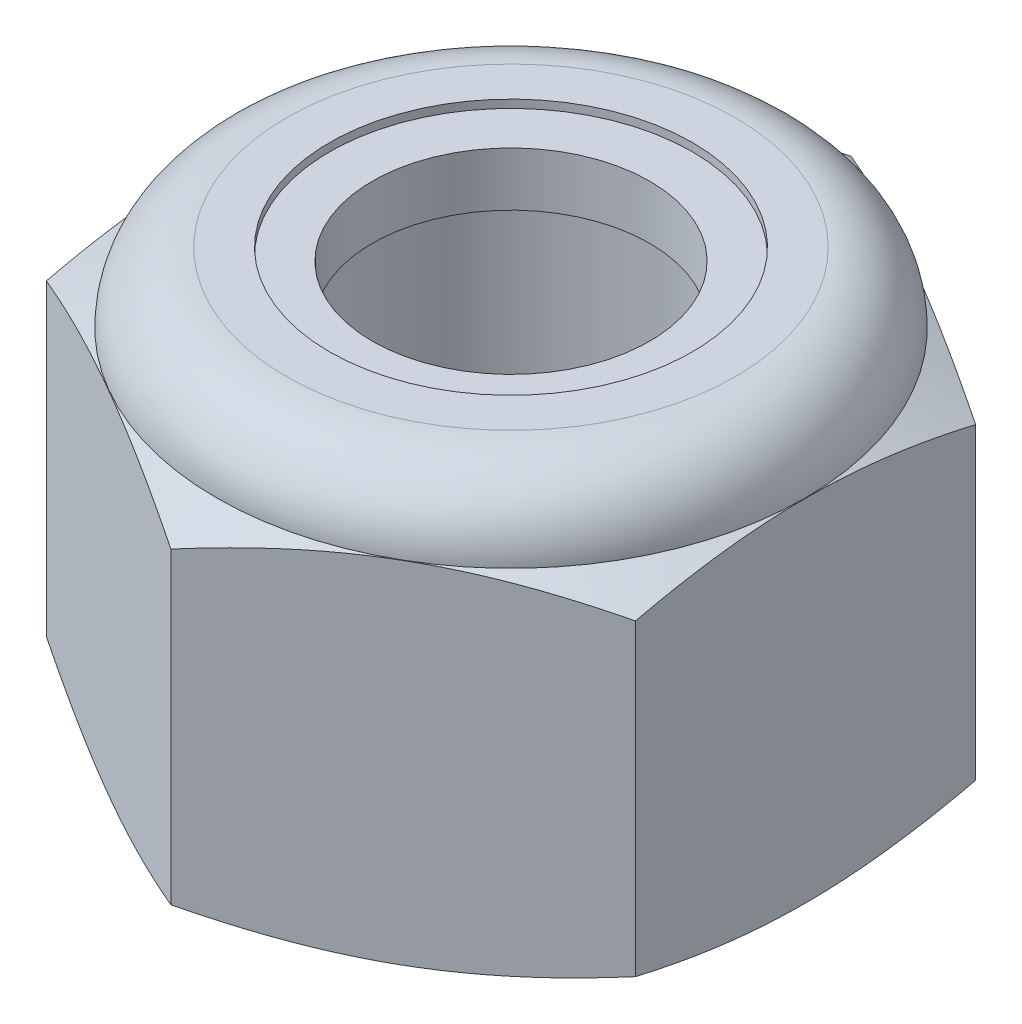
from build123d import *

# Parameters (mm, degrees)
BOSS_EXTRUDE1_DEPTH = 7.9375
SKETCH2_R           = 3.175
CUT_EXTRUDE1_DEPTH  = 12.620601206


with BuildPart() as part:
    # Sketch1 → Boss-Extrude1 (new body)
    with BuildSketch(Plane(origin=(0, 0, 0), x_dir=(1, 0, 0), z_dir=(0, 1, 0))):
        Polygon((0, 6.415804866), (-5.55625, 3.207902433), (-5.55625, -3.207902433), (0, -6.415804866), (5.55625, -3.207902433), (5.55625, 3.207902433), align=None)
    extrude(amount=BOSS_EXTRUDE1_DEPTH)

    # Sketch2 → Cut-Extrude1 (cut, through all)
    with BuildSketch(Plane(origin=(0, 7.9375, 0), x_dir=(1, 0, 0), z_dir=(0, 1, 0))):
        with Locations(Location((0, 0, 0), (0, 0, 270))):
            Circle(SKETCH2_R)
    extrude(amount=-CUT_EXTRUDE1_DEPTH, mode=Mode.SUBTRACT)

    # Sketch4 → Cut-Revolve1 (revolve, cut)
    with BuildSketch(Plane(origin=(0, 0, 0), x_dir=(0, 0, -1), z_dir=(1, 0, 0))):
        with BuildLine():
            Line((0, 0), (5.552204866, 0))
            Line((5.552204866, 0), (6.415804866, 0.402703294))
            Line((6.415804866, 0.402703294), (6.415804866, 6.213996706))
            Line((6.415804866, 6.213996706), (5.552204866, 6.6167))
            ThreePointArc((5.552204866, 6.6167), (5.165351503, 7.550646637), (4.231404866, 7.9375))
            Line((4.231404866, 7.9375), (4.231404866, 9.2075))
            Line((4.231404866, 9.2075), (7.685804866, 9.2075))
            Line((7.685804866, 9.2075), (7.685804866, -1.27))
            Line((7.685804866, -1.27), (0, -1.27))
            Line((0, -1.27), (0, 0))
        make_face()
    revolve(axis=Axis((0, 0, 0), (0, 1, 0)), mode=Mode.SUBTRACT)

    # Sketch5 → Cut-Revolve2 (revolve, cut)
    with BuildSketch(Plane(origin=(0, 0, 0), x_dir=(0, 0, -1), z_dir=(1, 0, 0))):
        with BuildLine():
            Line((5.399804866, 6.6167), (0, 6.6167))
            Line((0, 6.6167), (0, 9.1567))
            Line((0, 9.1567), (3.421620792, 9.1567))
            Line((3.421620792, 9.1567), (3.421620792, 7.7851))
            Line((3.421620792, 7.7851), (4.231404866, 7.7851))
            ThreePointArc((4.231404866, 7.7851), (5.05758843, 7.442883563), (5.399804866, 6.6167))
        make_face()
    revolve(axis=Axis((0, 6.6167, 0), (0, 1, 0)), mode=Mode.SUBTRACT)


with BuildPart() as body_2:
    # Sketch6 → Revolve1 (revolve)
    with BuildSketch(Plane(origin=(0, 0, 0), x_dir=(0, 0, -1), z_dir=(1, 0, 0))):
        with BuildLine():
            Line((2.6162, 6.6929), (2.6162, 7.7089))
            Line((2.6162, 7.7089), (4.231404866, 7.7089))
            ThreePointArc((4.231404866, 7.7089), (4.976279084, 7.415488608), (5.320943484, 6.6929))
            Line((5.320943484, 6.6929), (2.6162, 6.6929))
        make_face()
    revolve(axis=Axis((0, 0, 0), (0, 1, 0)))


solid = Compound([part.part, body_2.part])
